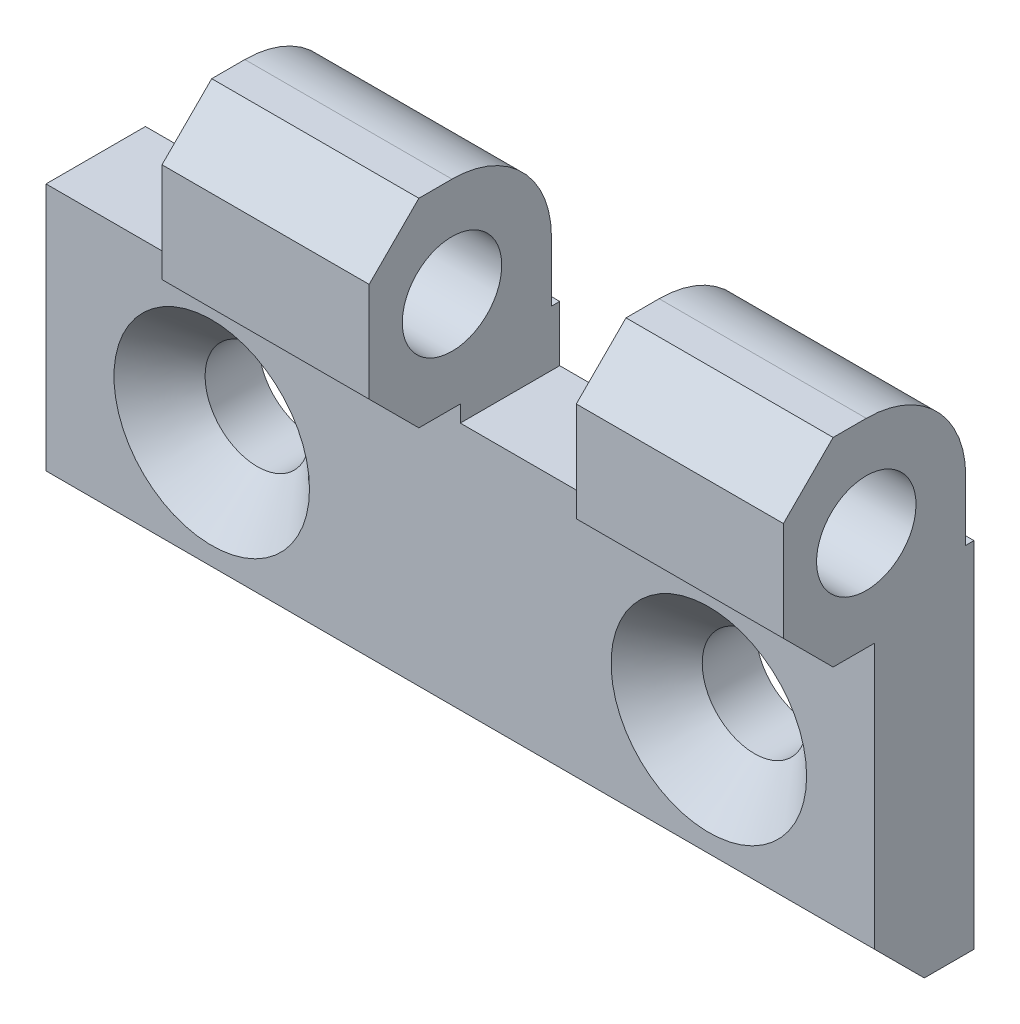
ISO-10303-21;
HEADER;
FILE_DESCRIPTION(('STEP AP214'),'2;1');
FILE_NAME('part.step','',(''),(''),'','','');
FILE_SCHEMA(('AUTOMOTIVE_DESIGN { 1 0 10303 214 1 1 1 1 }'));
ENDSEC;
DATA;
#1=APPLICATION_CONTEXT('core data for automotive mechanical design processes');
#2=APPLICATION_PROTOCOL_DEFINITION('international standard','automotive_design',2000,#1);
#3=PRODUCT_CONTEXT('',#1,'mechanical');
#4=PRODUCT('Part','Part','',(#3));
#5=PRODUCT_RELATED_PRODUCT_CATEGORY('part','',(#4));
#6=PRODUCT_DEFINITION_FORMATION('','',#4);
#7=PRODUCT_DEFINITION_CONTEXT('part definition',#1,'design');
#8=PRODUCT_DEFINITION('design','',#6,#7);
#9=PRODUCT_DEFINITION_SHAPE('','',#8);
#10=(LENGTH_UNIT() NAMED_UNIT(*) SI_UNIT(.MILLI.,.METRE.));
#11=(NAMED_UNIT(*) PLANE_ANGLE_UNIT() SI_UNIT($,.RADIAN.));
#12=(NAMED_UNIT(*) SI_UNIT($,.STERADIAN.) SOLID_ANGLE_UNIT());
#13=UNCERTAINTY_MEASURE_WITH_UNIT(LENGTH_MEASURE(1.E-05),#10,'distance_accuracy_value','');
#14=(GEOMETRIC_REPRESENTATION_CONTEXT(3) GLOBAL_UNCERTAINTY_ASSIGNED_CONTEXT((#13)) GLOBAL_UNIT_ASSIGNED_CONTEXT((#10,
#11,#12)) REPRESENTATION_CONTEXT('',''));
#15=CARTESIAN_POINT('',(0.,0.,0.));
#16=DIRECTION('',(0.,0.,1.));
#17=DIRECTION('',(1.,0.,0.));
#18=AXIS2_PLACEMENT_3D('',#15,#16,#17);
#19=CARTESIAN_POINT('',(-10.,15.,6.5));
#20=DIRECTION('',(1.,0.,0.));
#21=DIRECTION('',(0.,1.,0.));
#22=AXIS2_PLACEMENT_3D('',#19,#20,#21);
#23=CYLINDRICAL_SURFACE('',#22,6.);
#24=DIRECTION('',(1.,0.,0.));
#25=VECTOR('',#24,1.);
#26=CARTESIAN_POINT('',(-10.,15.,0.5));
#27=LINE('',#26,#25);
#28=CARTESIAN_POINT('',(27.5,15.,0.5));
#29=VERTEX_POINT('',#28);
#30=CARTESIAN_POINT('',(40.,15.,0.5));
#31=VERTEX_POINT('',#30);
#32=EDGE_CURVE('E368',#29,#31,#27,.T.);
#33=ORIENTED_EDGE('',*,*,#32,.F.);
#34=CARTESIAN_POINT('',(27.5,15.,6.5));
#35=DIRECTION('',(-1.,0.,0.));
#36=DIRECTION('',(0.,-1.,0.));
#37=AXIS2_PLACEMENT_3D('',#34,#35,#36);
#38=CIRCLE('',#37,6.);
#39=CARTESIAN_POINT('',(27.5,21.,6.5));
#40=VERTEX_POINT('',#39);
#41=EDGE_CURVE('E310',#29,#40,#38,.F.);
#42=ORIENTED_EDGE('',*,*,#41,.T.);
#43=DIRECTION('',(1.,0.,0.));
#44=VECTOR('',#43,1.);
#45=CARTESIAN_POINT('',(-10.,21.,6.5));
#46=LINE('',#45,#44);
#47=CARTESIAN_POINT('',(40.,21.,6.5));
#48=VERTEX_POINT('',#47);
#49=EDGE_CURVE('E358',#40,#48,#46,.T.);
#50=ORIENTED_EDGE('',*,*,#49,.T.);
#51=CARTESIAN_POINT('',(40.,15.,6.5));
#52=DIRECTION('',(1.,0.,0.));
#53=DIRECTION('',(0.,1.,0.));
#54=AXIS2_PLACEMENT_3D('',#51,#52,#53);
#55=CIRCLE('',#54,6.);
#56=EDGE_CURVE('E336',#31,#48,#55,.T.);
#57=ORIENTED_EDGE('',*,*,#56,.F.);
#58=EDGE_LOOP('',(#33,#42,#50,#57));
#59=FACE_BOUND('',#58,.T.);
#60=ADVANCED_FACE('F17',(#59),#23,.T.);
#61=CARTESIAN_POINT('',(15.,15.,6.5));
#62=DIRECTION('',(-1.,0.,0.));
#63=DIRECTION('',(0.,-1.,0.));
#64=AXIS2_PLACEMENT_3D('',#61,#62,#63);
#65=CIRCLE('',#64,6.);
#66=CARTESIAN_POINT('',(15.,15.,0.5));
#67=VERTEX_POINT('',#66);
#68=CARTESIAN_POINT('',(15.,21.,6.5));
#69=VERTEX_POINT('',#68);
#70=EDGE_CURVE('E288',#67,#69,#65,.F.);
#71=ORIENTED_EDGE('',*,*,#70,.F.);
#72=CARTESIAN_POINT('',(2.5,15.,0.5));
#73=VERTEX_POINT('',#72);
#74=EDGE_CURVE('E370',#73,#67,#27,.T.);
#75=ORIENTED_EDGE('',*,*,#74,.F.);
#76=CARTESIAN_POINT('',(2.5,15.,6.5));
#77=DIRECTION('',(-1.,0.,0.));
#78=DIRECTION('',(0.,-1.,0.));
#79=AXIS2_PLACEMENT_3D('',#76,#77,#78);
#80=CIRCLE('',#79,6.);
#81=CARTESIAN_POINT('',(2.5,21.,6.5));
#82=VERTEX_POINT('',#81);
#83=EDGE_CURVE('E265',#73,#82,#80,.F.);
#84=ORIENTED_EDGE('',*,*,#83,.T.);
#85=EDGE_CURVE('E360',#82,#69,#46,.T.);
#86=ORIENTED_EDGE('',*,*,#85,.T.);
#87=EDGE_LOOP('',(#71,#75,#84,#86));
#88=FACE_BOUND('',#87,.T.);
#89=ADVANCED_FACE('F468',(#88),#23,.T.);
#90=CARTESIAN_POINT('',(-10.,15.,0.5));
#91=DIRECTION('',(0.,0.,1.));
#92=DIRECTION('',(0.,-1.,0.));
#93=AXIS2_PLACEMENT_3D('',#90,#91,#92);
#94=PLANE('',#93);
#95=DIRECTION('',(0.,-1.,0.));
#96=VECTOR('',#95,1.);
#97=CARTESIAN_POINT('',(27.5,15.,0.5));
#98=LINE('',#97,#96);
#99=CARTESIAN_POINT('',(27.5,11.36,0.5));
#100=VERTEX_POINT('',#99);
#101=EDGE_CURVE('E319',#29,#100,#98,.T.);
#102=ORIENTED_EDGE('',*,*,#101,.F.);
#103=ORIENTED_EDGE('',*,*,#32,.T.);
#104=DIRECTION('',(0.,-1.,0.));
#105=VECTOR('',#104,1.);
#106=CARTESIAN_POINT('',(40.,15.,0.5));
#107=LINE('',#106,#105);
#108=CARTESIAN_POINT('',(40.,11.36,0.5));
#109=VERTEX_POINT('',#108);
#110=EDGE_CURVE('E350',#31,#109,#107,.T.);
#111=ORIENTED_EDGE('',*,*,#110,.T.);
#112=DIRECTION('',(1.,0.,0.));
#113=VECTOR('',#112,1.);
#114=CARTESIAN_POINT('',(-10.,11.36,0.5));
#115=LINE('',#114,#113);
#116=EDGE_CURVE('E365',#100,#109,#115,.T.);
#117=ORIENTED_EDGE('',*,*,#116,.F.);
#118=EDGE_LOOP('',(#102,#103,#111,#117));
#119=FACE_BOUND('',#118,.T.);
#120=ADVANCED_FACE('F19',(#119),#94,.F.);
#121=ORIENTED_EDGE('',*,*,#74,.T.);
#122=DIRECTION('',(0.,-1.,0.));
#123=VECTOR('',#122,1.);
#124=CARTESIAN_POINT('',(15.,15.,0.5));
#125=LINE('',#124,#123);
#126=CARTESIAN_POINT('',(15.,11.36,0.5));
#127=VERTEX_POINT('',#126);
#128=EDGE_CURVE('E295',#67,#127,#125,.T.);
#129=ORIENTED_EDGE('',*,*,#128,.T.);
#130=CARTESIAN_POINT('',(2.5,11.36,0.5));
#131=VERTEX_POINT('',#130);
#132=EDGE_CURVE('E367',#131,#127,#115,.T.);
#133=ORIENTED_EDGE('',*,*,#132,.F.);
#134=DIRECTION('',(0.,-1.,0.));
#135=VECTOR('',#134,1.);
#136=CARTESIAN_POINT('',(2.5,15.,0.5));
#137=LINE('',#136,#135);
#138=EDGE_CURVE('E274',#73,#131,#137,.T.);
#139=ORIENTED_EDGE('',*,*,#138,.F.);
#140=EDGE_LOOP('',(#121,#129,#133,#139));
#141=FACE_BOUND('',#140,.T.);
#142=ADVANCED_FACE('F475',(#141),#94,.F.);
#143=CARTESIAN_POINT('',(-10.,11.36,0.5));
#144=DIRECTION('',(0.,-1.,0.));
#145=DIRECTION('',(1.,0.,0.));
#146=AXIS2_PLACEMENT_3D('',#143,#144,#145);
#147=PLANE('',#146);
#148=DIRECTION('',(0.,0.,-1.));
#149=VECTOR('',#148,1.);
#150=CARTESIAN_POINT('',(27.5,11.36,0.5));
#151=LINE('',#150,#149);
#152=CARTESIAN_POINT('',(27.5,11.36,0.));
#153=VERTEX_POINT('',#152);
#154=EDGE_CURVE('E321',#100,#153,#151,.T.);
#155=ORIENTED_EDGE('',*,*,#154,.F.);
#156=ORIENTED_EDGE('',*,*,#116,.T.);
#157=DIRECTION('',(0.,0.,-1.));
#158=VECTOR('',#157,1.);
#159=CARTESIAN_POINT('',(40.,11.36,0.5));
#160=LINE('',#159,#158);
#161=CARTESIAN_POINT('',(40.,11.36,0.));
#162=VERTEX_POINT('',#161);
#163=EDGE_CURVE('E347',#109,#162,#160,.T.);
#164=ORIENTED_EDGE('',*,*,#163,.T.);
#165=DIRECTION('',(1.,0.,0.));
#166=VECTOR('',#165,1.);
#167=CARTESIAN_POINT('',(-10.,11.36,0.));
#168=LINE('',#167,#166);
#169=EDGE_CURVE('E362',#153,#162,#168,.T.);
#170=ORIENTED_EDGE('',*,*,#169,.F.);
#171=EDGE_LOOP('',(#155,#156,#164,#170));
#172=FACE_BOUND('',#171,.T.);
#173=ADVANCED_FACE('F423',(#172),#147,.F.);
#174=ORIENTED_EDGE('',*,*,#132,.T.);
#175=DIRECTION('',(0.,0.,-1.));
#176=VECTOR('',#175,1.);
#177=CARTESIAN_POINT('',(15.,11.36,0.5));
#178=LINE('',#177,#176);
#179=CARTESIAN_POINT('',(15.,11.36,0.));
#180=VERTEX_POINT('',#179);
#181=EDGE_CURVE('E298',#127,#180,#178,.T.);
#182=ORIENTED_EDGE('',*,*,#181,.T.);
#183=CARTESIAN_POINT('',(2.5,11.36,0.));
#184=VERTEX_POINT('',#183);
#185=EDGE_CURVE('E364',#184,#180,#168,.T.);
#186=ORIENTED_EDGE('',*,*,#185,.F.);
#187=DIRECTION('',(0.,0.,-1.));
#188=VECTOR('',#187,1.);
#189=CARTESIAN_POINT('',(2.5,11.36,0.5));
#190=LINE('',#189,#188);
#191=EDGE_CURVE('E276',#131,#184,#190,.T.);
#192=ORIENTED_EDGE('',*,*,#191,.F.);
#193=EDGE_LOOP('',(#174,#182,#186,#192));
#194=FACE_BOUND('',#193,.T.);
#195=ADVANCED_FACE('F478',(#194),#147,.F.);
#196=CARTESIAN_POINT('',(-10.,-10.,0.));
#197=DIRECTION('',(0.,0.,-1.));
#198=DIRECTION('',(0.,1.,0.));
#199=AXIS2_PLACEMENT_3D('',#196,#197,#198);
#200=PLANE('',#199);
#201=CARTESIAN_POINT('',(0.,0.,0.));
#202=DIRECTION('',(0.,0.,-1.));
#203=DIRECTION('',(0.,1.,0.));
#204=AXIS2_PLACEMENT_3D('',#201,#202,#203);
#205=CIRCLE('',#204,3.15);
#206=CARTESIAN_POINT('',(0.,3.15,0.));
#207=VERTEX_POINT('',#206);
#208=EDGE_CURVE('E250',#207,#207,#205,.T.);
#209=ORIENTED_EDGE('',*,*,#208,.F.);
#210=EDGE_LOOP('',(#209));
#211=FACE_BOUND('',#210,.T.);
#212=CARTESIAN_POINT('',(30.,0.,0.));
#213=DIRECTION('',(0.,0.,-1.));
#214=DIRECTION('',(0.,1.,0.));
#215=AXIS2_PLACEMENT_3D('',#212,#213,#214);
#216=CIRCLE('',#215,3.15);
#217=CARTESIAN_POINT('',(30.,3.15,0.));
#218=VERTEX_POINT('',#217);
#219=EDGE_CURVE('E253',#218,#218,#216,.T.);
#220=ORIENTED_EDGE('',*,*,#219,.F.);
#221=EDGE_LOOP('',(#220));
#222=FACE_BOUND('',#221,.T.);
#223=DIRECTION('',(-1.,0.,0.));
#224=VECTOR('',#223,1.);
#225=CARTESIAN_POINT('',(-10.,8.,0.));
#226=LINE('',#225,#224);
#227=CARTESIAN_POINT('',(27.5,8.,0.));
#228=VERTEX_POINT('',#227);
#229=CARTESIAN_POINT('',(15.,8.,0.));
#230=VERTEX_POINT('',#229);
#231=EDGE_CURVE('E331',#228,#230,#226,.T.);
#232=ORIENTED_EDGE('',*,*,#231,.F.);
#233=DIRECTION('',(0.,1.,0.));
#234=VECTOR('',#233,1.);
#235=CARTESIAN_POINT('',(27.5,-10.,0.));
#236=LINE('',#235,#234);
#237=EDGE_CURVE('E323',#228,#153,#236,.T.);
#238=ORIENTED_EDGE('',*,*,#237,.T.);
#239=ORIENTED_EDGE('',*,*,#169,.T.);
#240=DIRECTION('',(0.,1.,0.));
#241=VECTOR('',#240,1.);
#242=CARTESIAN_POINT('',(40.,-10.,0.));
#243=LINE('',#242,#241);
#244=CARTESIAN_POINT('',(40.,-10.,0.));
#245=VERTEX_POINT('',#244);
#246=EDGE_CURVE('E195',#245,#162,#243,.T.);
#247=ORIENTED_EDGE('',*,*,#246,.F.);
#248=DIRECTION('',(1.,0.,0.));
#249=VECTOR('',#248,1.);
#250=CARTESIAN_POINT('',(-10.,-10.,0.));
#251=LINE('',#250,#249);
#252=CARTESIAN_POINT('',(-10.,-10.,0.));
#253=VERTEX_POINT('',#252);
#254=EDGE_CURVE('E190',#253,#245,#251,.T.);
#255=ORIENTED_EDGE('',*,*,#254,.F.);
#256=DIRECTION('',(0.,1.,0.));
#257=VECTOR('',#256,1.);
#258=CARTESIAN_POINT('',(-10.,-10.,0.));
#259=LINE('',#258,#257);
#260=CARTESIAN_POINT('',(-10.,8.,0.));
#261=VERTEX_POINT('',#260);
#262=EDGE_CURVE('E355',#253,#261,#259,.T.);
#263=ORIENTED_EDGE('',*,*,#262,.T.);
#264=DIRECTION('',(-1.,0.,0.));
#265=VECTOR('',#264,1.);
#266=CARTESIAN_POINT('',(-10.,8.,0.));
#267=LINE('',#266,#265);
#268=CARTESIAN_POINT('',(2.5,8.,0.));
#269=VERTEX_POINT('',#268);
#270=EDGE_CURVE('E329',#269,#261,#267,.T.);
#271=ORIENTED_EDGE('',*,*,#270,.F.);
#272=DIRECTION('',(0.,1.,0.));
#273=VECTOR('',#272,1.);
#274=CARTESIAN_POINT('',(2.5,-10.,0.));
#275=LINE('',#274,#273);
#276=EDGE_CURVE('E278',#269,#184,#275,.T.);
#277=ORIENTED_EDGE('',*,*,#276,.T.);
#278=ORIENTED_EDGE('',*,*,#185,.T.);
#279=DIRECTION('',(0.,1.,0.));
#280=VECTOR('',#279,1.);
#281=CARTESIAN_POINT('',(15.,-10.,0.));
#282=LINE('',#281,#280);
#283=EDGE_CURVE('E301',#230,#180,#282,.T.);
#284=ORIENTED_EDGE('',*,*,#283,.F.);
#285=EDGE_LOOP('',(#232,#238,#239,#247,#255,#263,#271,#277,#278,#284));
#286=FACE_BOUND('',#285,.T.);
#287=ADVANCED_FACE('F427',(#211,#222,#286),#200,.T.);
#288=CARTESIAN_POINT('',(-10.,9.,11.5));
#289=DIRECTION('',(0.,-1.,0.));
#290=DIRECTION('',(1.,0.,0.));
#291=AXIS2_PLACEMENT_3D('',#288,#289,#290);
#292=PLANE('',#291);
#293=DIRECTION('',(-1.,0.,0.));
#294=VECTOR('',#293,1.);
#295=CARTESIAN_POINT('',(40.,9.,6.));
#296=LINE('',#295,#294);
#297=CARTESIAN_POINT('',(40.,9.,6.));
#298=VERTEX_POINT('',#297);
#299=CARTESIAN_POINT('',(27.5,9.,6.));
#300=VERTEX_POINT('',#299);
#301=EDGE_CURVE('E226',#298,#300,#296,.T.);
#302=ORIENTED_EDGE('',*,*,#301,.F.);
#303=DIRECTION('',(0.,0.,-1.));
#304=VECTOR('',#303,1.);
#305=CARTESIAN_POINT('',(40.,9.,11.5));
#306=LINE('',#305,#304);
#307=CARTESIAN_POINT('',(40.,9.,8.5));
#308=VERTEX_POINT('',#307);
#309=EDGE_CURVE('E196',#308,#298,#306,.T.);
#310=ORIENTED_EDGE('',*,*,#309,.F.);
#311=DIRECTION('',(-1.,0.,0.));
#312=VECTOR('',#311,1.);
#313=CARTESIAN_POINT('',(-10.,9.,8.5));
#314=LINE('',#313,#312);
#315=CARTESIAN_POINT('',(27.5,9.,8.5));
#316=VERTEX_POINT('',#315);
#317=EDGE_CURVE('E382',#308,#316,#314,.T.);
#318=ORIENTED_EDGE('',*,*,#317,.T.);
#319=DIRECTION('',(0.,0.,-1.));
#320=VECTOR('',#319,1.);
#321=CARTESIAN_POINT('',(27.5,9.,11.5));
#322=LINE('',#321,#320);
#323=EDGE_CURVE('E316',#316,#300,#322,.T.);
#324=ORIENTED_EDGE('',*,*,#323,.T.);
#325=EDGE_LOOP('',(#302,#310,#318,#324));
#326=FACE_BOUND('',#325,.T.);
#327=ADVANCED_FACE('F493',(#326),#292,.T.);
#328=DIRECTION('',(-1.,0.,0.));
#329=VECTOR('',#328,1.);
#330=CARTESIAN_POINT('',(15.,9.,6.));
#331=LINE('',#330,#329);
#332=CARTESIAN_POINT('',(15.,9.,6.));
#333=VERTEX_POINT('',#332);
#334=CARTESIAN_POINT('',(2.5,9.,6.));
#335=VERTEX_POINT('',#334);
#336=EDGE_CURVE('E237',#333,#335,#331,.T.);
#337=ORIENTED_EDGE('',*,*,#336,.F.);
#338=DIRECTION('',(0.,0.,-1.));
#339=VECTOR('',#338,1.);
#340=CARTESIAN_POINT('',(15.,9.,11.5));
#341=LINE('',#340,#339);
#342=CARTESIAN_POINT('',(15.,9.,8.5));
#343=VERTEX_POINT('',#342);
#344=EDGE_CURVE('E292',#343,#333,#341,.T.);
#345=ORIENTED_EDGE('',*,*,#344,.F.);
#346=CARTESIAN_POINT('',(2.5,9.,8.5));
#347=VERTEX_POINT('',#346);
#348=EDGE_CURVE('E386',#343,#347,#314,.T.);
#349=ORIENTED_EDGE('',*,*,#348,.T.);
#350=DIRECTION('',(0.,0.,-1.));
#351=VECTOR('',#350,1.);
#352=CARTESIAN_POINT('',(2.5,9.,11.5));
#353=LINE('',#352,#351);
#354=EDGE_CURVE('E271',#347,#335,#353,.T.);
#355=ORIENTED_EDGE('',*,*,#354,.T.);
#356=EDGE_LOOP('',(#337,#345,#349,#355));
#357=FACE_BOUND('',#356,.T.);
#358=ADVANCED_FACE('F446',(#357),#292,.T.);
#359=CARTESIAN_POINT('',(-10.,9.,11.5));
#360=DIRECTION('',(0.,0.,-1.));
#361=DIRECTION('',(-1.,0.,0.));
#362=AXIS2_PLACEMENT_3D('',#359,#360,#361);
#363=PLANE('',#362);
#364=DIRECTION('',(0.,1.,0.));
#365=VECTOR('',#364,1.);
#366=CARTESIAN_POINT('',(27.5,9.,11.5));
#367=LINE('',#366,#365);
#368=CARTESIAN_POINT('',(27.5,12.,11.5));
#369=VERTEX_POINT('',#368);
#370=CARTESIAN_POINT('',(27.5,18.,11.5));
#371=VERTEX_POINT('',#370);
#372=EDGE_CURVE('E308',#369,#371,#367,.T.);
#373=ORIENTED_EDGE('',*,*,#372,.F.);
#374=DIRECTION('',(1.,0.,0.));
#375=VECTOR('',#374,1.);
#376=CARTESIAN_POINT('',(40.,12.,11.5));
#377=LINE('',#376,#375);
#378=CARTESIAN_POINT('',(40.,12.,11.5));
#379=VERTEX_POINT('',#378);
#380=EDGE_CURVE('E379',#369,#379,#377,.T.);
#381=ORIENTED_EDGE('',*,*,#380,.T.);
#382=DIRECTION('',(0.,1.,0.));
#383=VECTOR('',#382,1.);
#384=CARTESIAN_POINT('',(40.,9.,11.5));
#385=LINE('',#384,#383);
#386=CARTESIAN_POINT('',(40.,18.,11.5));
#387=VERTEX_POINT('',#386);
#388=EDGE_CURVE('E342',#379,#387,#385,.T.);
#389=ORIENTED_EDGE('',*,*,#388,.T.);
#390=DIRECTION('',(-1.,0.,0.));
#391=VECTOR('',#390,1.);
#392=CARTESIAN_POINT('',(-10.,18.,11.5));
#393=LINE('',#392,#391);
#394=EDGE_CURVE('E376',#387,#371,#393,.T.);
#395=ORIENTED_EDGE('',*,*,#394,.T.);
#396=EDGE_LOOP('',(#373,#381,#389,#395));
#397=FACE_BOUND('',#396,.T.);
#398=ADVANCED_FACE('F402',(#397),#363,.F.);
#399=CARTESIAN_POINT('',(2.5,12.,11.5));
#400=VERTEX_POINT('',#399);
#401=CARTESIAN_POINT('',(15.,12.,11.5));
#402=VERTEX_POINT('',#401);
#403=EDGE_CURVE('E381',#400,#402,#377,.T.);
#404=ORIENTED_EDGE('',*,*,#403,.T.);
#405=DIRECTION('',(0.,1.,0.));
#406=VECTOR('',#405,1.);
#407=CARTESIAN_POINT('',(15.,9.,11.5));
#408=LINE('',#407,#406);
#409=CARTESIAN_POINT('',(15.,18.,11.5));
#410=VERTEX_POINT('',#409);
#411=EDGE_CURVE('E285',#402,#410,#408,.T.);
#412=ORIENTED_EDGE('',*,*,#411,.T.);
#413=CARTESIAN_POINT('',(2.5,18.,11.5));
#414=VERTEX_POINT('',#413);
#415=EDGE_CURVE('E375',#410,#414,#393,.T.);
#416=ORIENTED_EDGE('',*,*,#415,.T.);
#417=DIRECTION('',(0.,1.,0.));
#418=VECTOR('',#417,1.);
#419=CARTESIAN_POINT('',(2.5,9.,11.5));
#420=LINE('',#419,#418);
#421=EDGE_CURVE('E40',#400,#414,#420,.T.);
#422=ORIENTED_EDGE('',*,*,#421,.F.);
#423=EDGE_LOOP('',(#404,#412,#416,#422));
#424=FACE_BOUND('',#423,.T.);
#425=ADVANCED_FACE('F452',(#424),#363,.F.);
#426=CARTESIAN_POINT('',(-10.,21.,11.5));
#427=DIRECTION('',(0.,-1.,0.));
#428=DIRECTION('',(0.,0.,-1.));
#429=AXIS2_PLACEMENT_3D('',#426,#427,#428);
#430=PLANE('',#429);
#431=DIRECTION('',(0.,0.,-1.));
#432=VECTOR('',#431,1.);
#433=CARTESIAN_POINT('',(27.5,21.,11.5));
#434=LINE('',#433,#432);
#435=CARTESIAN_POINT('',(27.5,21.,8.5));
#436=VERTEX_POINT('',#435);
#437=EDGE_CURVE('E306',#436,#40,#434,.T.);
#438=ORIENTED_EDGE('',*,*,#437,.F.);
#439=DIRECTION('',(1.,0.,0.));
#440=VECTOR('',#439,1.);
#441=CARTESIAN_POINT('',(-10.,21.,8.5));
#442=LINE('',#441,#440);
#443=CARTESIAN_POINT('',(40.,21.,8.5));
#444=VERTEX_POINT('',#443);
#445=EDGE_CURVE('E385',#436,#444,#442,.T.);
#446=ORIENTED_EDGE('',*,*,#445,.T.);
#447=DIRECTION('',(0.,0.,-1.));
#448=VECTOR('',#447,1.);
#449=CARTESIAN_POINT('',(40.,21.,11.5));
#450=LINE('',#449,#448);
#451=EDGE_CURVE('E339',#444,#48,#450,.T.);
#452=ORIENTED_EDGE('',*,*,#451,.T.);
#453=ORIENTED_EDGE('',*,*,#49,.F.);
#454=EDGE_LOOP('',(#438,#446,#452,#453));
#455=FACE_BOUND('',#454,.T.);
#456=ADVANCED_FACE('F412',(#455),#430,.F.);
#457=CARTESIAN_POINT('',(2.5,21.,8.5));
#458=VERTEX_POINT('',#457);
#459=CARTESIAN_POINT('',(15.,21.,8.5));
#460=VERTEX_POINT('',#459);
#461=EDGE_CURVE('E388',#458,#460,#442,.T.);
#462=ORIENTED_EDGE('',*,*,#461,.T.);
#463=DIRECTION('',(0.,0.,-1.));
#464=VECTOR('',#463,1.);
#465=CARTESIAN_POINT('',(15.,21.,11.5));
#466=LINE('',#465,#464);
#467=EDGE_CURVE('E32',#460,#69,#466,.T.);
#468=ORIENTED_EDGE('',*,*,#467,.T.);
#469=ORIENTED_EDGE('',*,*,#85,.F.);
#470=DIRECTION('',(0.,0.,-1.));
#471=VECTOR('',#470,1.);
#472=CARTESIAN_POINT('',(2.5,21.,11.5));
#473=LINE('',#472,#471);
#474=EDGE_CURVE('E262',#458,#82,#473,.T.);
#475=ORIENTED_EDGE('',*,*,#474,.F.);
#476=EDGE_LOOP('',(#462,#468,#469,#475));
#477=FACE_BOUND('',#476,.T.);
#478=ADVANCED_FACE('F464',(#477),#430,.F.);
#479=CARTESIAN_POINT('',(-10.,15.,6.5));
#480=DIRECTION('',(1.,0.,0.));
#481=DIRECTION('',(0.,1.,0.));
#482=AXIS2_PLACEMENT_3D('',#479,#480,#481);
#483=CYLINDRICAL_SURFACE('',#482,3.);
#484=CARTESIAN_POINT('',(40.,15.,6.5));
#485=DIRECTION('',(1.,0.,0.));
#486=DIRECTION('',(0.,1.,0.));
#487=AXIS2_PLACEMENT_3D('',#484,#485,#486);
#488=CIRCLE('',#487,3.);
#489=CARTESIAN_POINT('',(40.,18.,6.5));
#490=VERTEX_POINT('',#489);
#491=EDGE_CURVE('E333',#490,#490,#488,.T.);
#492=ORIENTED_EDGE('',*,*,#491,.T.);
#493=EDGE_LOOP('',(#492));
#494=FACE_BOUND('',#493,.T.);
#495=CARTESIAN_POINT('',(27.5,15.,6.5));
#496=DIRECTION('',(-1.,0.,0.));
#497=DIRECTION('',(0.,-1.,0.));
#498=AXIS2_PLACEMENT_3D('',#495,#496,#497);
#499=CIRCLE('',#498,3.);
#500=CARTESIAN_POINT('',(27.5,12.,6.5));
#501=VERTEX_POINT('',#500);
#502=EDGE_CURVE('E326',#501,#501,#499,.F.);
#503=ORIENTED_EDGE('',*,*,#502,.F.);
#504=EDGE_LOOP('',(#503));
#505=FACE_BOUND('',#504,.T.);
#506=ADVANCED_FACE('F498',(#494,#505),#483,.F.);
#507=CARTESIAN_POINT('',(-10.,12.,11.5));
#508=DIRECTION('',(0.,-0.707106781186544,0.707106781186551));
#509=DIRECTION('',(0.,-0.707106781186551,-0.707106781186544));
#510=AXIS2_PLACEMENT_3D('',#507,#508,#509);
#511=PLANE('',#510);
#512=ORIENTED_EDGE('',*,*,#380,.F.);
#513=DIRECTION('',(0.,-0.707106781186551,-0.707106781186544));
#514=VECTOR('',#513,1.);
#515=CARTESIAN_POINT('',(27.5,12.,11.5));
#516=LINE('',#515,#514);
#517=EDGE_CURVE('E313',#369,#316,#516,.T.);
#518=ORIENTED_EDGE('',*,*,#517,.T.);
#519=ORIENTED_EDGE('',*,*,#317,.F.);
#520=DIRECTION('',(0.,-0.707106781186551,-0.707106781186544));
#521=VECTOR('',#520,1.);
#522=CARTESIAN_POINT('',(40.,11.,10.5));
#523=LINE('',#522,#521);
#524=EDGE_CURVE('E373',#379,#308,#523,.T.);
#525=ORIENTED_EDGE('',*,*,#524,.F.);
#526=EDGE_LOOP('',(#512,#518,#519,#525));
#527=FACE_BOUND('',#526,.T.);
#528=ADVANCED_FACE('F496',(#527),#511,.T.);
#529=DIRECTION('',(0.,-0.707106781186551,-0.707106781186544));
#530=VECTOR('',#529,1.);
#531=CARTESIAN_POINT('',(15.,12.,11.5));
#532=LINE('',#531,#530);
#533=EDGE_CURVE('E290',#402,#343,#532,.T.);
#534=ORIENTED_EDGE('',*,*,#533,.F.);
#535=ORIENTED_EDGE('',*,*,#403,.F.);
#536=DIRECTION('',(0.,-0.707106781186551,-0.707106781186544));
#537=VECTOR('',#536,1.);
#538=CARTESIAN_POINT('',(2.5,12.,11.5));
#539=LINE('',#538,#537);
#540=EDGE_CURVE('E268',#400,#347,#539,.T.);
#541=ORIENTED_EDGE('',*,*,#540,.T.);
#542=ORIENTED_EDGE('',*,*,#348,.F.);
#543=EDGE_LOOP('',(#534,#535,#541,#542));
#544=FACE_BOUND('',#543,.T.);
#545=ADVANCED_FACE('F448',(#544),#511,.T.);
#546=CARTESIAN_POINT('',(-10.,21.,8.5));
#547=DIRECTION('',(0.,-0.707106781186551,-0.707106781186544));
#548=DIRECTION('',(0.,0.707106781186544,-0.707106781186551));
#549=AXIS2_PLACEMENT_3D('',#546,#547,#548);
#550=PLANE('',#549);
#551=ORIENTED_EDGE('',*,*,#445,.F.);
#552=DIRECTION('',(0.,0.707106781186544,-0.707106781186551));
#553=VECTOR('',#552,1.);
#554=CARTESIAN_POINT('',(27.5,21.,8.5));
#555=LINE('',#554,#553);
#556=EDGE_CURVE('E25',#436,#371,#555,.F.);
#557=ORIENTED_EDGE('',*,*,#556,.T.);
#558=ORIENTED_EDGE('',*,*,#394,.F.);
#559=DIRECTION('',(0.,0.707106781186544,-0.707106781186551));
#560=VECTOR('',#559,1.);
#561=CARTESIAN_POINT('',(40.,19.,10.5));
#562=LINE('',#561,#560);
#563=EDGE_CURVE('E371',#444,#387,#562,.F.);
#564=ORIENTED_EDGE('',*,*,#563,.F.);
#565=EDGE_LOOP('',(#551,#557,#558,#564));
#566=FACE_BOUND('',#565,.T.);
#567=ADVANCED_FACE('F396',(#566),#550,.F.);
#568=DIRECTION('',(0.,0.707106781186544,-0.707106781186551));
#569=VECTOR('',#568,1.);
#570=CARTESIAN_POINT('',(15.,21.,8.5));
#571=LINE('',#570,#569);
#572=EDGE_CURVE('E391',#460,#410,#571,.F.);
#573=ORIENTED_EDGE('',*,*,#572,.F.);
#574=ORIENTED_EDGE('',*,*,#461,.F.);
#575=DIRECTION('',(0.,0.707106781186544,-0.707106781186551));
#576=VECTOR('',#575,1.);
#577=CARTESIAN_POINT('',(2.5,21.,8.5));
#578=LINE('',#577,#576);
#579=EDGE_CURVE('E389',#458,#414,#578,.F.);
#580=ORIENTED_EDGE('',*,*,#579,.T.);
#581=ORIENTED_EDGE('',*,*,#415,.F.);
#582=EDGE_LOOP('',(#573,#574,#580,#581));
#583=FACE_BOUND('',#582,.T.);
#584=ADVANCED_FACE('F456',(#583),#550,.F.);
#585=CARTESIAN_POINT('',(-10.,-10.,0.));
#586=DIRECTION('',(0.,1.,0.));
#587=DIRECTION('',(-1.,0.,0.));
#588=AXIS2_PLACEMENT_3D('',#585,#586,#587);
#589=PLANE('',#588);
#590=DIRECTION('',(0.,0.,1.));
#591=VECTOR('',#590,1.);
#592=CARTESIAN_POINT('',(40.,-10.,0.));
#593=LINE('',#592,#591);
#594=CARTESIAN_POINT('',(40.,-10.,3.));
#595=VERTEX_POINT('',#594);
#596=EDGE_CURVE('E184',#245,#595,#593,.T.);
#597=ORIENTED_EDGE('',*,*,#596,.T.);
#598=DIRECTION('',(-1.,0.,0.));
#599=VECTOR('',#598,1.);
#600=CARTESIAN_POINT('',(40.,-10.,3.));
#601=LINE('',#600,#599);
#602=CARTESIAN_POINT('',(-10.,-10.,3.));
#603=VERTEX_POINT('',#602);
#604=EDGE_CURVE('E188',#595,#603,#601,.T.);
#605=ORIENTED_EDGE('',*,*,#604,.T.);
#606=DIRECTION('',(0.,0.,1.));
#607=VECTOR('',#606,1.);
#608=CARTESIAN_POINT('',(-10.,-10.,0.));
#609=LINE('',#608,#607);
#610=EDGE_CURVE('E353',#253,#603,#609,.T.);
#611=ORIENTED_EDGE('',*,*,#610,.F.);
#612=ORIENTED_EDGE('',*,*,#254,.T.);
#613=EDGE_LOOP('',(#597,#605,#611,#612));
#614=FACE_BOUND('',#613,.T.);
#615=ADVANCED_FACE('F186',(#614),#589,.F.);
#616=CARTESIAN_POINT('',(-10.,15.,6.5));
#617=DIRECTION('',(1.,0.,0.));
#618=DIRECTION('',(0.,1.,0.));
#619=AXIS2_PLACEMENT_3D('',#616,#617,#618);
#620=PLANE('',#619);
#621=ORIENTED_EDGE('',*,*,#610,.T.);
#622=DIRECTION('',(0.,0.707106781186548,0.707106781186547));
#623=VECTOR('',#622,1.);
#624=CARTESIAN_POINT('',(-10.,-10.,3.));
#625=LINE('',#624,#623);
#626=CARTESIAN_POINT('',(-10.,-7.,6.));
#627=VERTEX_POINT('',#626);
#628=EDGE_CURVE('E204',#603,#627,#625,.T.);
#629=ORIENTED_EDGE('',*,*,#628,.T.);
#630=DIRECTION('',(0.,-1.,0.));
#631=VECTOR('',#630,1.);
#632=CARTESIAN_POINT('',(-10.,8.,6.));
#633=LINE('',#632,#631);
#634=CARTESIAN_POINT('',(-10.,8.,6.));
#635=VERTEX_POINT('',#634);
#636=EDGE_CURVE('E245',#635,#627,#633,.T.);
#637=ORIENTED_EDGE('',*,*,#636,.F.);
#638=DIRECTION('',(0.,0.,-1.));
#639=VECTOR('',#638,1.);
#640=CARTESIAN_POINT('',(-10.,8.,6.5));
#641=LINE('',#640,#639);
#642=EDGE_CURVE('E11',#635,#261,#641,.T.);
#643=ORIENTED_EDGE('',*,*,#642,.T.);
#644=ORIENTED_EDGE('',*,*,#262,.F.);
#645=EDGE_LOOP('',(#621,#629,#637,#643,#644));
#646=FACE_BOUND('',#645,.T.);
#647=ADVANCED_FACE('F489',(#646),#620,.F.);
#648=CARTESIAN_POINT('',(40.,15.,6.5));
#649=DIRECTION('',(1.,0.,0.));
#650=DIRECTION('',(0.,1.,0.));
#651=AXIS2_PLACEMENT_3D('',#648,#649,#650);
#652=PLANE('',#651);
#653=DIRECTION('',(0.,0.707106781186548,0.707106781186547));
#654=VECTOR('',#653,1.);
#655=CARTESIAN_POINT('',(40.,-10.,3.));
#656=LINE('',#655,#654);
#657=CARTESIAN_POINT('',(40.,-7.,6.));
#658=VERTEX_POINT('',#657);
#659=EDGE_CURVE('E202',#595,#658,#656,.T.);
#660=ORIENTED_EDGE('',*,*,#659,.F.);
#661=ORIENTED_EDGE('',*,*,#596,.F.);
#662=ORIENTED_EDGE('',*,*,#246,.T.);
#663=ORIENTED_EDGE('',*,*,#163,.F.);
#664=ORIENTED_EDGE('',*,*,#110,.F.);
#665=ORIENTED_EDGE('',*,*,#56,.T.);
#666=ORIENTED_EDGE('',*,*,#451,.F.);
#667=ORIENTED_EDGE('',*,*,#563,.T.);
#668=ORIENTED_EDGE('',*,*,#388,.F.);
#669=ORIENTED_EDGE('',*,*,#524,.T.);
#670=ORIENTED_EDGE('',*,*,#309,.T.);
#671=DIRECTION('',(0.,1.,0.));
#672=VECTOR('',#671,1.);
#673=CARTESIAN_POINT('',(40.,-7.,6.));
#674=LINE('',#673,#672);
#675=EDGE_CURVE('E211',#658,#298,#674,.T.);
#676=ORIENTED_EDGE('',*,*,#675,.F.);
#677=EDGE_LOOP('',(#660,#661,#662,#663,#664,#665,#666,#667,#668,#669,#670,#676));
#678=FACE_BOUND('',#677,.T.);
#679=ORIENTED_EDGE('',*,*,#491,.F.);
#680=EDGE_LOOP('',(#679));
#681=FACE_BOUND('',#680,.T.);
#682=ADVANCED_FACE('F208',(#678,#681),#652,.T.);
#683=CARTESIAN_POINT('',(2.5,35.,-8.5));
#684=DIRECTION('',(-1.,0.,0.));
#685=DIRECTION('',(0.,-1.,0.));
#686=AXIS2_PLACEMENT_3D('',#683,#684,#685);
#687=PLANE('',#686);
#688=DIRECTION('',(0.,0.,1.));
#689=VECTOR('',#688,1.);
#690=CARTESIAN_POINT('',(2.5,8.,-8.5));
#691=LINE('',#690,#689);
#692=CARTESIAN_POINT('',(2.5,8.,6.));
#693=VERTEX_POINT('',#692);
#694=EDGE_CURVE('E256',#269,#693,#691,.T.);
#695=ORIENTED_EDGE('',*,*,#694,.T.);
#696=DIRECTION('',(0.,-1.,0.));
#697=VECTOR('',#696,1.);
#698=CARTESIAN_POINT('',(2.5,9.,6.));
#699=LINE('',#698,#697);
#700=EDGE_CURVE('E239',#335,#693,#699,.T.);
#701=ORIENTED_EDGE('',*,*,#700,.F.);
#702=ORIENTED_EDGE('',*,*,#354,.F.);
#703=ORIENTED_EDGE('',*,*,#540,.F.);
#704=ORIENTED_EDGE('',*,*,#421,.T.);
#705=ORIENTED_EDGE('',*,*,#579,.F.);
#706=ORIENTED_EDGE('',*,*,#474,.T.);
#707=ORIENTED_EDGE('',*,*,#83,.F.);
#708=ORIENTED_EDGE('',*,*,#138,.T.);
#709=ORIENTED_EDGE('',*,*,#191,.T.);
#710=ORIENTED_EDGE('',*,*,#276,.F.);
#711=EDGE_LOOP('',(#695,#701,#702,#703,#704,#705,#706,#707,#708,#709,#710));
#712=FACE_BOUND('',#711,.T.);
#713=CARTESIAN_POINT('',(2.5,15.,6.5));
#714=DIRECTION('',(-1.,0.,0.));
#715=DIRECTION('',(0.,-1.,0.));
#716=AXIS2_PLACEMENT_3D('',#713,#714,#715);
#717=CIRCLE('',#716,3.);
#718=CARTESIAN_POINT('',(2.5,12.,6.5));
#719=VERTEX_POINT('',#718);
#720=EDGE_CURVE('E281',#719,#719,#717,.F.);
#721=ORIENTED_EDGE('',*,*,#720,.T.);
#722=EDGE_LOOP('',(#721));
#723=FACE_BOUND('',#722,.T.);
#724=ADVANCED_FACE('F460',(#712,#723),#687,.T.);
#725=CARTESIAN_POINT('',(-30.,8.,-8.5));
#726=DIRECTION('',(0.,-1.,0.));
#727=DIRECTION('',(1.,0.,0.));
#728=AXIS2_PLACEMENT_3D('',#725,#726,#727);
#729=PLANE('',#728);
#730=ORIENTED_EDGE('',*,*,#270,.T.);
#731=ORIENTED_EDGE('',*,*,#642,.F.);
#732=DIRECTION('',(-1.,0.,0.));
#733=VECTOR('',#732,1.);
#734=CARTESIAN_POINT('',(2.5,8.,6.));
#735=LINE('',#734,#733);
#736=EDGE_CURVE('E242',#693,#635,#735,.T.);
#737=ORIENTED_EDGE('',*,*,#736,.F.);
#738=ORIENTED_EDGE('',*,*,#694,.F.);
#739=EDGE_LOOP('',(#730,#731,#737,#738));
#740=FACE_BOUND('',#739,.T.);
#741=ADVANCED_FACE('F485',(#740),#729,.F.);
#742=CARTESIAN_POINT('',(15.,8.,-8.5));
#743=DIRECTION('',(0.,-1.,0.));
#744=DIRECTION('',(1.,0.,0.));
#745=AXIS2_PLACEMENT_3D('',#742,#743,#744);
#746=PLANE('',#745);
#747=ORIENTED_EDGE('',*,*,#231,.T.);
#748=DIRECTION('',(0.,0.,1.));
#749=VECTOR('',#748,1.);
#750=CARTESIAN_POINT('',(15.,8.,-8.5));
#751=LINE('',#750,#749);
#752=CARTESIAN_POINT('',(15.,8.,6.));
#753=VERTEX_POINT('',#752);
#754=EDGE_CURVE('E258',#230,#753,#751,.T.);
#755=ORIENTED_EDGE('',*,*,#754,.T.);
#756=DIRECTION('',(-1.,0.,0.));
#757=VECTOR('',#756,1.);
#758=CARTESIAN_POINT('',(27.5,8.,6.));
#759=LINE('',#758,#757);
#760=CARTESIAN_POINT('',(27.5,8.,6.));
#761=VERTEX_POINT('',#760);
#762=EDGE_CURVE('E232',#761,#753,#759,.T.);
#763=ORIENTED_EDGE('',*,*,#762,.F.);
#764=DIRECTION('',(0.,0.,1.));
#765=VECTOR('',#764,1.);
#766=CARTESIAN_POINT('',(27.5,8.,-8.5));
#767=LINE('',#766,#765);
#768=EDGE_CURVE('E260',#228,#761,#767,.T.);
#769=ORIENTED_EDGE('',*,*,#768,.F.);
#770=EDGE_LOOP('',(#747,#755,#763,#769));
#771=FACE_BOUND('',#770,.T.);
#772=ADVANCED_FACE('F432',(#771),#746,.F.);
#773=CARTESIAN_POINT('',(27.5,35.,-8.5));
#774=DIRECTION('',(-1.,0.,0.));
#775=DIRECTION('',(0.,-1.,0.));
#776=AXIS2_PLACEMENT_3D('',#773,#774,#775);
#777=PLANE('',#776);
#778=ORIENTED_EDGE('',*,*,#768,.T.);
#779=DIRECTION('',(0.,-1.,0.));
#780=VECTOR('',#779,1.);
#781=CARTESIAN_POINT('',(27.5,9.,6.));
#782=LINE('',#781,#780);
#783=EDGE_CURVE('E229',#300,#761,#782,.T.);
#784=ORIENTED_EDGE('',*,*,#783,.F.);
#785=ORIENTED_EDGE('',*,*,#323,.F.);
#786=ORIENTED_EDGE('',*,*,#517,.F.);
#787=ORIENTED_EDGE('',*,*,#372,.T.);
#788=ORIENTED_EDGE('',*,*,#556,.F.);
#789=ORIENTED_EDGE('',*,*,#437,.T.);
#790=ORIENTED_EDGE('',*,*,#41,.F.);
#791=ORIENTED_EDGE('',*,*,#101,.T.);
#792=ORIENTED_EDGE('',*,*,#154,.T.);
#793=ORIENTED_EDGE('',*,*,#237,.F.);
#794=EDGE_LOOP('',(#778,#784,#785,#786,#787,#788,#789,#790,#791,#792,#793));
#795=FACE_BOUND('',#794,.T.);
#796=ORIENTED_EDGE('',*,*,#502,.T.);
#797=EDGE_LOOP('',(#796));
#798=FACE_BOUND('',#797,.T.);
#799=ADVANCED_FACE('F413',(#795,#798),#777,.T.);
#800=CARTESIAN_POINT('',(15.,35.,-8.5));
#801=DIRECTION('',(-1.,0.,0.));
#802=DIRECTION('',(0.,-1.,0.));
#803=AXIS2_PLACEMENT_3D('',#800,#801,#802);
#804=PLANE('',#803);
#805=ORIENTED_EDGE('',*,*,#283,.T.);
#806=ORIENTED_EDGE('',*,*,#181,.F.);
#807=ORIENTED_EDGE('',*,*,#128,.F.);
#808=ORIENTED_EDGE('',*,*,#70,.T.);
#809=ORIENTED_EDGE('',*,*,#467,.F.);
#810=ORIENTED_EDGE('',*,*,#572,.T.);
#811=ORIENTED_EDGE('',*,*,#411,.F.);
#812=ORIENTED_EDGE('',*,*,#533,.T.);
#813=ORIENTED_EDGE('',*,*,#344,.T.);
#814=DIRECTION('',(0.,1.,0.));
#815=VECTOR('',#814,1.);
#816=CARTESIAN_POINT('',(15.,8.,6.));
#817=LINE('',#816,#815);
#818=EDGE_CURVE('E235',#753,#333,#817,.T.);
#819=ORIENTED_EDGE('',*,*,#818,.F.);
#820=ORIENTED_EDGE('',*,*,#754,.F.);
#821=EDGE_LOOP('',(#805,#806,#807,#808,#809,#810,#811,#812,#813,#819,#820));
#822=FACE_BOUND('',#821,.T.);
#823=CARTESIAN_POINT('',(15.,15.,6.5));
#824=DIRECTION('',(-1.,0.,0.));
#825=DIRECTION('',(0.,-1.,0.));
#826=AXIS2_PLACEMENT_3D('',#823,#824,#825);
#827=CIRCLE('',#826,3.);
#828=CARTESIAN_POINT('',(15.,12.,6.5));
#829=VERTEX_POINT('',#828);
#830=EDGE_CURVE('E303',#829,#829,#827,.F.);
#831=ORIENTED_EDGE('',*,*,#830,.F.);
#832=EDGE_LOOP('',(#831));
#833=FACE_BOUND('',#832,.T.);
#834=ADVANCED_FACE('F439',(#822,#833),#804,.F.);
#835=ORIENTED_EDGE('',*,*,#830,.T.);
#836=EDGE_LOOP('',(#835));
#837=FACE_BOUND('',#836,.T.);
#838=ORIENTED_EDGE('',*,*,#720,.F.);
#839=EDGE_LOOP('',(#838));
#840=FACE_BOUND('',#839,.T.);
#841=ADVANCED_FACE('F508',(#837,#840),#483,.F.);
#842=CARTESIAN_POINT('',(30.,0.,5.));
#843=DIRECTION('',(0.,0.,-1.));
#844=DIRECTION('',(0.,1.,0.));
#845=AXIS2_PLACEMENT_3D('',#842,#843,#844);
#846=CYLINDRICAL_SURFACE('',#845,3.15);
#847=ORIENTED_EDGE('',*,*,#219,.T.);
#848=EDGE_LOOP('',(#847));
#849=FACE_BOUND('',#848,.T.);
#850=CARTESIAN_POINT('',(30.,0.,3.25));
#851=DIRECTION('',(0.,0.,-1.));
#852=DIRECTION('',(-1.,0.,0.));
#853=AXIS2_PLACEMENT_3D('',#850,#851,#852);
#854=CIRCLE('',#853,3.15);
#855=CARTESIAN_POINT('',(26.85,0.,3.25));
#856=VERTEX_POINT('',#855);
#857=EDGE_CURVE('E205',#856,#856,#854,.T.);
#858=ORIENTED_EDGE('',*,*,#857,.F.);
#859=EDGE_LOOP('',(#858));
#860=FACE_BOUND('',#859,.T.);
#861=ADVANCED_FACE('F662',(#849,#860),#846,.F.);
#862=CARTESIAN_POINT('',(0.,0.,5.));
#863=DIRECTION('',(0.,0.,-1.));
#864=DIRECTION('',(0.,1.,0.));
#865=AXIS2_PLACEMENT_3D('',#862,#863,#864);
#866=CYLINDRICAL_SURFACE('',#865,3.15);
#867=ORIENTED_EDGE('',*,*,#208,.T.);
#868=EDGE_LOOP('',(#867));
#869=FACE_BOUND('',#868,.T.);
#870=CARTESIAN_POINT('',(0.,0.,3.25));
#871=DIRECTION('',(0.,0.,-1.));
#872=DIRECTION('',(-1.,0.,0.));
#873=AXIS2_PLACEMENT_3D('',#870,#871,#872);
#874=CIRCLE('',#873,3.15);
#875=CARTESIAN_POINT('',(-3.15,0.,3.25));
#876=VERTEX_POINT('',#875);
#877=EDGE_CURVE('E217',#876,#876,#874,.T.);
#878=ORIENTED_EDGE('',*,*,#877,.F.);
#879=EDGE_LOOP('',(#878));
#880=FACE_BOUND('',#879,.T.);
#881=ADVANCED_FACE('F672',(#869,#880),#866,.F.);
#882=CARTESIAN_POINT('',(0.,0.,6.));
#883=DIRECTION('',(0.,0.,1.));
#884=DIRECTION('',(1.,0.,0.));
#885=AXIS2_PLACEMENT_3D('',#882,#883,#884);
#886=PLANE('',#885);
#887=CARTESIAN_POINT('',(30.,0.,6.));
#888=DIRECTION('',(0.,0.,1.));
#889=DIRECTION('',(1.,0.,0.));
#890=AXIS2_PLACEMENT_3D('',#887,#888,#889);
#891=CIRCLE('',#890,5.9);
#892=CARTESIAN_POINT('',(35.9,0.,6.));
#893=VERTEX_POINT('',#892);
#894=EDGE_CURVE('E223',#893,#893,#891,.T.);
#895=ORIENTED_EDGE('',*,*,#894,.F.);
#896=EDGE_LOOP('',(#895));
#897=FACE_BOUND('',#896,.T.);
#898=ORIENTED_EDGE('',*,*,#301,.T.);
#899=ORIENTED_EDGE('',*,*,#783,.T.);
#900=ORIENTED_EDGE('',*,*,#762,.T.);
#901=ORIENTED_EDGE('',*,*,#818,.T.);
#902=ORIENTED_EDGE('',*,*,#336,.T.);
#903=ORIENTED_EDGE('',*,*,#700,.T.);
#904=ORIENTED_EDGE('',*,*,#736,.T.);
#905=ORIENTED_EDGE('',*,*,#636,.T.);
#906=DIRECTION('',(1.,0.,0.));
#907=VECTOR('',#906,1.);
#908=CARTESIAN_POINT('',(-10.,-7.,6.));
#909=LINE('',#908,#907);
#910=EDGE_CURVE('E247',#627,#658,#909,.T.);
#911=ORIENTED_EDGE('',*,*,#910,.T.);
#912=ORIENTED_EDGE('',*,*,#675,.T.);
#913=EDGE_LOOP('',(#898,#899,#900,#901,#902,#903,#904,#905,#911,#912));
#914=FACE_BOUND('',#913,.T.);
#915=CARTESIAN_POINT('',(0.,0.,6.));
#916=DIRECTION('',(0.,0.,1.));
#917=DIRECTION('',(1.,0.,0.));
#918=AXIS2_PLACEMENT_3D('',#915,#916,#917);
#919=CIRCLE('',#918,5.9);
#920=CARTESIAN_POINT('',(5.9,0.,6.));
#921=VERTEX_POINT('',#920);
#922=EDGE_CURVE('E220',#921,#921,#919,.T.);
#923=ORIENTED_EDGE('',*,*,#922,.F.);
#924=EDGE_LOOP('',(#923));
#925=FACE_BOUND('',#924,.T.);
#926=ADVANCED_FACE('F436',(#897,#914,#925),#886,.T.);
#927=CARTESIAN_POINT('',(0.,0.,3.25));
#928=DIRECTION('',(0.,0.,1.));
#929=DIRECTION('',(1.,0.,0.));
#930=AXIS2_PLACEMENT_3D('',#927,#928,#929);
#931=CONICAL_SURFACE('',#930,3.15,0.785398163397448);
#932=ORIENTED_EDGE('',*,*,#922,.T.);
#933=EDGE_LOOP('',(#932));
#934=FACE_BOUND('',#933,.T.);
#935=ORIENTED_EDGE('',*,*,#877,.T.);
#936=EDGE_LOOP('',(#935));
#937=FACE_BOUND('',#936,.T.);
#938=ADVANCED_FACE('F690',(#934,#937),#931,.F.);
#939=CARTESIAN_POINT('',(30.,0.,3.25));
#940=DIRECTION('',(0.,0.,1.));
#941=DIRECTION('',(1.,0.,0.));
#942=AXIS2_PLACEMENT_3D('',#939,#940,#941);
#943=CONICAL_SURFACE('',#942,3.15,0.785398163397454);
#944=ORIENTED_EDGE('',*,*,#894,.T.);
#945=EDGE_LOOP('',(#944));
#946=FACE_BOUND('',#945,.T.);
#947=ORIENTED_EDGE('',*,*,#857,.T.);
#948=EDGE_LOOP('',(#947));
#949=FACE_BOUND('',#948,.T.);
#950=ADVANCED_FACE('F699',(#946,#949),#943,.F.);
#951=CARTESIAN_POINT('',(40.,-10.,3.));
#952=DIRECTION('',(0.,-0.707106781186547,0.707106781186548));
#953=DIRECTION('',(0.,-0.707106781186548,-0.707106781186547));
#954=AXIS2_PLACEMENT_3D('',#951,#952,#953);
#955=PLANE('',#954);
#956=ORIENTED_EDGE('',*,*,#628,.F.);
#957=ORIENTED_EDGE('',*,*,#604,.F.);
#958=ORIENTED_EDGE('',*,*,#659,.T.);
#959=ORIENTED_EDGE('',*,*,#910,.F.);
#960=EDGE_LOOP('',(#956,#957,#958,#959));
#961=FACE_BOUND('',#960,.T.);
#962=ADVANCED_FACE('F200',(#961),#955,.T.);
#963=CLOSED_SHELL('',(#60,#89,#120,#142,#173,#195,#287,#327,#358,#398,#425,#456,#478,#506,#528,
#545,#567,#584,#615,#647,#682,#724,#741,#772,#799,#834,#841,#861,#881,#926,#938,#950,#962));
#964=MANIFOLD_SOLID_BREP('B1',#963);
#965=ADVANCED_BREP_SHAPE_REPRESENTATION('',(#18,#964),#14);
#966=SHAPE_DEFINITION_REPRESENTATION(#9,#965);
ENDSEC;
END-ISO-10303-21;
